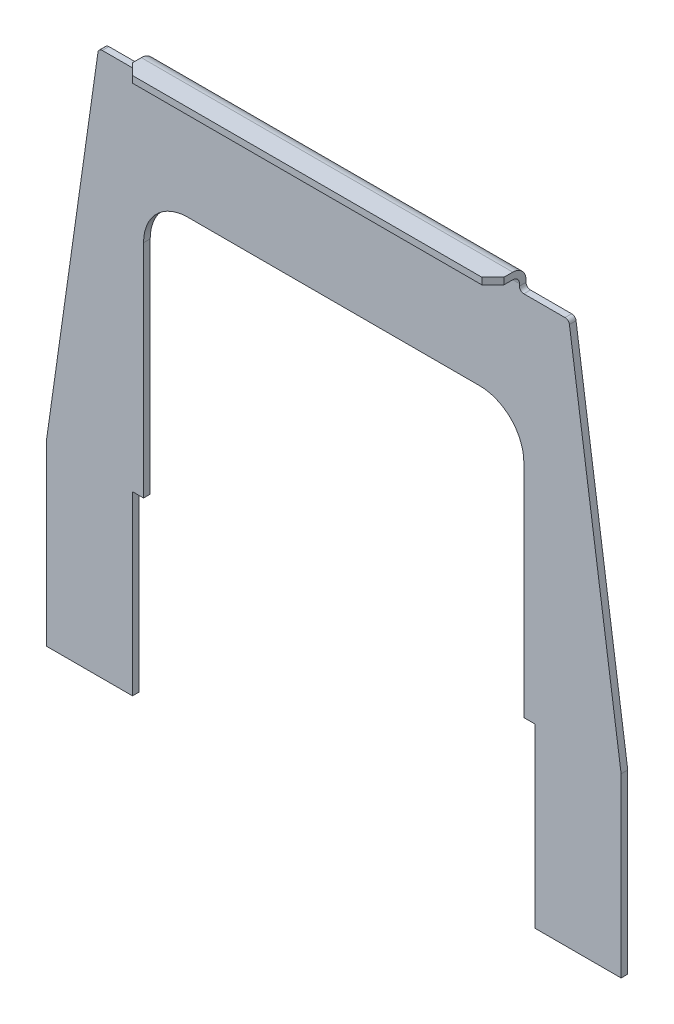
ISO-10303-21;
HEADER;
FILE_DESCRIPTION(('STEP AP214'),'2;1');
FILE_NAME('part.step','',(''),(''),'','','');
FILE_SCHEMA(('AUTOMOTIVE_DESIGN { 1 0 10303 214 1 1 1 1 }'));
ENDSEC;
DATA;
#1=APPLICATION_CONTEXT('core data for automotive mechanical design processes');
#2=APPLICATION_PROTOCOL_DEFINITION('international standard','automotive_design',2000,#1);
#3=PRODUCT_CONTEXT('',#1,'mechanical');
#4=PRODUCT('Part','Part','',(#3));
#5=PRODUCT_RELATED_PRODUCT_CATEGORY('part','',(#4));
#6=PRODUCT_DEFINITION_FORMATION('','',#4);
#7=PRODUCT_DEFINITION_CONTEXT('part definition',#1,'design');
#8=PRODUCT_DEFINITION('design','',#6,#7);
#9=PRODUCT_DEFINITION_SHAPE('','',#8);
#10=(LENGTH_UNIT() NAMED_UNIT(*) SI_UNIT(.MILLI.,.METRE.));
#11=(NAMED_UNIT(*) PLANE_ANGLE_UNIT() SI_UNIT($,.RADIAN.));
#12=(NAMED_UNIT(*) SI_UNIT($,.STERADIAN.) SOLID_ANGLE_UNIT());
#13=UNCERTAINTY_MEASURE_WITH_UNIT(LENGTH_MEASURE(1.E-05),#10,'distance_accuracy_value','');
#14=(GEOMETRIC_REPRESENTATION_CONTEXT(3) GLOBAL_UNCERTAINTY_ASSIGNED_CONTEXT((#13)) GLOBAL_UNIT_ASSIGNED_CONTEXT((#10,
#11,#12)) REPRESENTATION_CONTEXT('',''));
#15=CARTESIAN_POINT('',(0.,0.,0.));
#16=DIRECTION('',(0.,0.,1.));
#17=DIRECTION('',(1.,0.,0.));
#18=AXIS2_PLACEMENT_3D('',#15,#16,#17);
#19=CARTESIAN_POINT('',(130.,252.,7.10707993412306));
#20=DIRECTION('',(0.,-1.,0.));
#21=DIRECTION('',(0.,0.,-1.));
#22=AXIS2_PLACEMENT_3D('',#19,#20,#21);
#23=PLANE('',#22);
#24=DIRECTION('',(1.,0.,0.));
#25=VECTOR('',#24,1.);
#26=CARTESIAN_POINT('',(130.,252.,6.00000000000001));
#27=LINE('',#26,#25);
#28=CARTESIAN_POINT('',(45.9999999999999,252.,6.00000000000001));
#29=VERTEX_POINT('',#28);
#30=CARTESIAN_POINT('',(214.,252.,6.00000000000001));
#31=VERTEX_POINT('',#30);
#32=EDGE_CURVE('E299',#29,#31,#27,.T.);
#33=ORIENTED_EDGE('',*,*,#32,.T.);
#34=DIRECTION('',(0.,0.,-1.));
#35=VECTOR('',#34,1.);
#36=CARTESIAN_POINT('',(214.,252.,6.00000000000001));
#37=LINE('',#36,#35);
#38=CARTESIAN_POINT('',(214.,252.,10.));
#39=VERTEX_POINT('',#38);
#40=EDGE_CURVE('E212',#39,#31,#37,.T.);
#41=ORIENTED_EDGE('',*,*,#40,.F.);
#42=DIRECTION('',(0.707106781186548,0.,-0.707106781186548));
#43=VECTOR('',#42,1.);
#44=CARTESIAN_POINT('',(211.5,252.,12.5));
#45=LINE('',#44,#43);
#46=CARTESIAN_POINT('',(209.,252.,15.));
#47=VERTEX_POINT('',#46);
#48=EDGE_CURVE('E353',#47,#39,#45,.T.);
#49=ORIENTED_EDGE('',*,*,#48,.F.);
#50=DIRECTION('',(1.,0.,0.));
#51=VECTOR('',#50,1.);
#52=CARTESIAN_POINT('',(214.,252.,15.));
#53=LINE('',#52,#51);
#54=CARTESIAN_POINT('',(50.9999999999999,252.,15.));
#55=VERTEX_POINT('',#54);
#56=EDGE_CURVE('E382',#55,#47,#53,.T.);
#57=ORIENTED_EDGE('',*,*,#56,.F.);
#58=DIRECTION('',(0.707106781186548,0.,0.707106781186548));
#59=VECTOR('',#58,1.);
#60=CARTESIAN_POINT('',(48.4999999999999,252.,12.5));
#61=LINE('',#60,#59);
#62=CARTESIAN_POINT('',(45.9999999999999,252.,10.));
#63=VERTEX_POINT('',#62);
#64=EDGE_CURVE('E370',#63,#55,#61,.T.);
#65=ORIENTED_EDGE('',*,*,#64,.F.);
#66=DIRECTION('',(0.,0.,1.));
#67=VECTOR('',#66,1.);
#68=CARTESIAN_POINT('',(45.9999999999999,252.,6.00000000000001));
#69=LINE('',#68,#67);
#70=EDGE_CURVE('E342',#29,#63,#69,.T.);
#71=ORIENTED_EDGE('',*,*,#70,.F.);
#72=EDGE_LOOP('',(#33,#41,#49,#57,#65,#71));
#73=FACE_BOUND('',#72,.T.);
#74=ADVANCED_FACE('F17',(#73),#23,.T.);
#75=CARTESIAN_POINT('',(214.,252.,15.));
#76=DIRECTION('',(0.,0.,1.));
#77=DIRECTION('',(0.,-1.,0.));
#78=AXIS2_PLACEMENT_3D('',#75,#76,#77);
#79=PLANE('',#78);
#80=DIRECTION('',(0.,1.,0.));
#81=VECTOR('',#80,1.);
#82=CARTESIAN_POINT('',(50.9999999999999,252.,15.));
#83=LINE('',#82,#81);
#84=CARTESIAN_POINT('',(50.9999999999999,255.,15.));
#85=VERTEX_POINT('',#84);
#86=EDGE_CURVE('E367',#55,#85,#83,.T.);
#87=ORIENTED_EDGE('',*,*,#86,.F.);
#88=ORIENTED_EDGE('',*,*,#56,.T.);
#89=DIRECTION('',(0.,1.,0.));
#90=VECTOR('',#89,1.);
#91=CARTESIAN_POINT('',(209.,252.,15.));
#92=LINE('',#91,#90);
#93=CARTESIAN_POINT('',(209.,255.,15.));
#94=VERTEX_POINT('',#93);
#95=EDGE_CURVE('E369',#94,#47,#92,.F.);
#96=ORIENTED_EDGE('',*,*,#95,.F.);
#97=DIRECTION('',(1.,0.,0.));
#98=VECTOR('',#97,1.);
#99=CARTESIAN_POINT('',(130.,255.,15.));
#100=LINE('',#99,#98);
#101=EDGE_CURVE('E298',#94,#85,#100,.F.);
#102=ORIENTED_EDGE('',*,*,#101,.T.);
#103=EDGE_LOOP('',(#87,#88,#96,#102));
#104=FACE_BOUND('',#103,.T.);
#105=ADVANCED_FACE('F850',(#104),#79,.T.);
#106=CARTESIAN_POINT('',(48.4999999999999,252.,12.5));
#107=DIRECTION('',(-0.707106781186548,0.,0.707106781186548));
#108=DIRECTION('',(0.707106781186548,0.,0.707106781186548));
#109=AXIS2_PLACEMENT_3D('',#106,#107,#108);
#110=PLANE('',#109);
#111=ORIENTED_EDGE('',*,*,#64,.T.);
#112=ORIENTED_EDGE('',*,*,#86,.T.);
#113=DIRECTION('',(-0.707106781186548,0.,-0.707106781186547));
#114=VECTOR('',#113,1.);
#115=CARTESIAN_POINT('',(50.9999999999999,255.,15.));
#116=LINE('',#115,#114);
#117=CARTESIAN_POINT('',(45.9999999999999,255.,10.));
#118=VERTEX_POINT('',#117);
#119=EDGE_CURVE('E285',#85,#118,#116,.T.);
#120=ORIENTED_EDGE('',*,*,#119,.T.);
#121=DIRECTION('',(0.,1.,0.));
#122=VECTOR('',#121,1.);
#123=CARTESIAN_POINT('',(45.9999999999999,252.,10.));
#124=LINE('',#123,#122);
#125=EDGE_CURVE('E345',#63,#118,#124,.T.);
#126=ORIENTED_EDGE('',*,*,#125,.F.);
#127=EDGE_LOOP('',(#111,#112,#120,#126));
#128=FACE_BOUND('',#127,.T.);
#129=ADVANCED_FACE('F840',(#128),#110,.T.);
#130=CARTESIAN_POINT('',(211.5,252.,12.5));
#131=DIRECTION('',(0.707106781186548,0.,0.707106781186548));
#132=DIRECTION('',(0.707106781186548,0.,-0.707106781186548));
#133=AXIS2_PLACEMENT_3D('',#130,#131,#132);
#134=PLANE('',#133);
#135=ORIENTED_EDGE('',*,*,#48,.T.);
#136=DIRECTION('',(0.,1.,0.));
#137=VECTOR('',#136,1.);
#138=CARTESIAN_POINT('',(214.,252.,10.));
#139=LINE('',#138,#137);
#140=CARTESIAN_POINT('',(214.,255.,10.));
#141=VERTEX_POINT('',#140);
#142=EDGE_CURVE('E349',#141,#39,#139,.F.);
#143=ORIENTED_EDGE('',*,*,#142,.F.);
#144=DIRECTION('',(-0.707106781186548,0.,0.707106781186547));
#145=VECTOR('',#144,1.);
#146=CARTESIAN_POINT('',(214.,255.,10.));
#147=LINE('',#146,#145);
#148=EDGE_CURVE('E224',#141,#94,#147,.T.);
#149=ORIENTED_EDGE('',*,*,#148,.T.);
#150=ORIENTED_EDGE('',*,*,#95,.T.);
#151=EDGE_LOOP('',(#135,#143,#149,#150));
#152=FACE_BOUND('',#151,.T.);
#153=ADVANCED_FACE('F831',(#152),#134,.T.);
#154=CARTESIAN_POINT('',(130.,249.,6.));
#155=DIRECTION('',(1.,0.,0.));
#156=DIRECTION('',(0.,0.,-1.));
#157=AXIS2_PLACEMENT_3D('',#154,#155,#156);
#158=CYLINDRICAL_SURFACE('',#157,3.);
#159=CARTESIAN_POINT('',(45.9999999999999,249.,6.));
#160=DIRECTION('',(1.,0.,0.));
#161=DIRECTION('',(0.,0.,-1.));
#162=AXIS2_PLACEMENT_3D('',#159,#160,#161);
#163=CIRCLE('',#162,3.);
#164=CARTESIAN_POINT('',(45.9999999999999,249.,3.));
#165=VERTEX_POINT('',#164);
#166=EDGE_CURVE('E223',#165,#29,#163,.T.);
#167=ORIENTED_EDGE('',*,*,#166,.F.);
#168=DIRECTION('',(1.,0.,0.));
#169=VECTOR('',#168,1.);
#170=CARTESIAN_POINT('',(130.,249.,3.));
#171=LINE('',#170,#169);
#172=CARTESIAN_POINT('',(214.,249.,3.));
#173=VERTEX_POINT('',#172);
#174=EDGE_CURVE('E226',#173,#165,#171,.F.);
#175=ORIENTED_EDGE('',*,*,#174,.F.);
#176=CARTESIAN_POINT('',(214.,249.,6.));
#177=DIRECTION('',(1.,0.,0.));
#178=DIRECTION('',(0.,0.,-1.));
#179=AXIS2_PLACEMENT_3D('',#176,#177,#178);
#180=CIRCLE('',#179,3.);
#181=EDGE_CURVE('E20',#31,#173,#180,.F.);
#182=ORIENTED_EDGE('',*,*,#181,.F.);
#183=ORIENTED_EDGE('',*,*,#32,.F.);
#184=EDGE_LOOP('',(#167,#175,#182,#183));
#185=FACE_BOUND('',#184,.T.);
#186=ADVANCED_FACE('F227',(#185),#158,.F.);
#187=CARTESIAN_POINT('',(130.,255.,7.10707993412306));
#188=DIRECTION('',(0.,-1.,0.));
#189=DIRECTION('',(0.,0.,-1.));
#190=AXIS2_PLACEMENT_3D('',#187,#188,#189);
#191=PLANE('',#190);
#192=DIRECTION('',(0.,0.,-1.));
#193=VECTOR('',#192,1.);
#194=CARTESIAN_POINT('',(214.,255.,7.10707993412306));
#195=LINE('',#194,#193);
#196=CARTESIAN_POINT('',(214.,255.,6.00000000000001));
#197=VERTEX_POINT('',#196);
#198=EDGE_CURVE('E284',#197,#141,#195,.F.);
#199=ORIENTED_EDGE('',*,*,#198,.F.);
#200=DIRECTION('',(1.,0.,0.));
#201=VECTOR('',#200,1.);
#202=CARTESIAN_POINT('',(130.,255.,6.00000000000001));
#203=LINE('',#202,#201);
#204=CARTESIAN_POINT('',(45.9999999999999,255.,6.00000000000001));
#205=VERTEX_POINT('',#204);
#206=EDGE_CURVE('E278',#205,#197,#203,.T.);
#207=ORIENTED_EDGE('',*,*,#206,.F.);
#208=DIRECTION('',(0.,0.,-1.));
#209=VECTOR('',#208,1.);
#210=CARTESIAN_POINT('',(45.9999999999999,255.,7.10707993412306));
#211=LINE('',#210,#209);
#212=EDGE_CURVE('E282',#118,#205,#211,.T.);
#213=ORIENTED_EDGE('',*,*,#212,.F.);
#214=ORIENTED_EDGE('',*,*,#119,.F.);
#215=ORIENTED_EDGE('',*,*,#101,.F.);
#216=ORIENTED_EDGE('',*,*,#148,.F.);
#217=EDGE_LOOP('',(#199,#207,#213,#214,#215,#216));
#218=FACE_BOUND('',#217,.T.);
#219=ADVANCED_FACE('F813',(#218),#191,.F.);
#220=CARTESIAN_POINT('',(214.,252.,6.00000000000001));
#221=DIRECTION('',(1.,0.,0.));
#222=DIRECTION('',(0.,0.,-1.));
#223=AXIS2_PLACEMENT_3D('',#220,#221,#222);
#224=PLANE('',#223);
#225=ORIENTED_EDGE('',*,*,#181,.T.);
#226=DIRECTION('',(0.,1.,0.));
#227=VECTOR('',#226,1.);
#228=CARTESIAN_POINT('',(214.,127.5,3.));
#229=LINE('',#228,#227);
#230=CARTESIAN_POINT('',(214.,248.,3.));
#231=VERTEX_POINT('',#230);
#232=EDGE_CURVE('E220',#231,#173,#229,.T.);
#233=ORIENTED_EDGE('',*,*,#232,.F.);
#234=DIRECTION('',(0.,0.,-1.));
#235=VECTOR('',#234,1.);
#236=CARTESIAN_POINT('',(214.,248.,3.));
#237=LINE('',#236,#235);
#238=CARTESIAN_POINT('',(214.,248.,0.));
#239=VERTEX_POINT('',#238);
#240=EDGE_CURVE('E450',#231,#239,#237,.T.);
#241=ORIENTED_EDGE('',*,*,#240,.T.);
#242=DIRECTION('',(0.,1.,0.));
#243=VECTOR('',#242,1.);
#244=CARTESIAN_POINT('',(214.,246.,0.));
#245=LINE('',#244,#243);
#246=CARTESIAN_POINT('',(214.,249.,0.));
#247=VERTEX_POINT('',#246);
#248=EDGE_CURVE('E296',#247,#239,#245,.F.);
#249=ORIENTED_EDGE('',*,*,#248,.F.);
#250=CARTESIAN_POINT('',(214.,249.,6.));
#251=DIRECTION('',(1.,0.,0.));
#252=DIRECTION('',(0.,0.,-1.));
#253=AXIS2_PLACEMENT_3D('',#250,#251,#252);
#254=CIRCLE('',#253,6.);
#255=EDGE_CURVE('E281',#197,#247,#254,.F.);
#256=ORIENTED_EDGE('',*,*,#255,.F.);
#257=ORIENTED_EDGE('',*,*,#198,.T.);
#258=ORIENTED_EDGE('',*,*,#142,.T.);
#259=ORIENTED_EDGE('',*,*,#40,.T.);
#260=EDGE_LOOP('',(#225,#233,#241,#249,#256,#257,#258,#259));
#261=FACE_BOUND('',#260,.T.);
#262=ADVANCED_FACE('F217',(#261),#224,.T.);
#263=CARTESIAN_POINT('',(45.9999999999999,255.,3.));
#264=DIRECTION('',(1.,0.,0.));
#265=DIRECTION('',(0.,1.,0.));
#266=AXIS2_PLACEMENT_3D('',#263,#264,#265);
#267=PLANE('',#266);
#268=DIRECTION('',(0.,1.,0.));
#269=VECTOR('',#268,1.);
#270=CARTESIAN_POINT('',(45.9999999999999,127.5,3.));
#271=LINE('',#270,#269);
#272=CARTESIAN_POINT('',(45.9999999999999,248.,3.));
#273=VERTEX_POINT('',#272);
#274=EDGE_CURVE('E231',#165,#273,#271,.F.);
#275=ORIENTED_EDGE('',*,*,#274,.F.);
#276=ORIENTED_EDGE('',*,*,#166,.T.);
#277=ORIENTED_EDGE('',*,*,#70,.T.);
#278=ORIENTED_EDGE('',*,*,#125,.T.);
#279=ORIENTED_EDGE('',*,*,#212,.T.);
#280=CARTESIAN_POINT('',(45.9999999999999,249.,6.));
#281=DIRECTION('',(1.,0.,0.));
#282=DIRECTION('',(0.,0.,-1.));
#283=AXIS2_PLACEMENT_3D('',#280,#281,#282);
#284=CIRCLE('',#283,6.);
#285=CARTESIAN_POINT('',(45.9999999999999,249.,0.));
#286=VERTEX_POINT('',#285);
#287=EDGE_CURVE('E418',#286,#205,#284,.T.);
#288=ORIENTED_EDGE('',*,*,#287,.F.);
#289=DIRECTION('',(0.,1.,0.));
#290=VECTOR('',#289,1.);
#291=CARTESIAN_POINT('',(45.9999999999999,255.,0.));
#292=LINE('',#291,#290);
#293=CARTESIAN_POINT('',(45.9999999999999,248.,0.));
#294=VERTEX_POINT('',#293);
#295=EDGE_CURVE('E237',#294,#286,#292,.T.);
#296=ORIENTED_EDGE('',*,*,#295,.F.);
#297=DIRECTION('',(0.,0.,-1.));
#298=VECTOR('',#297,1.);
#299=CARTESIAN_POINT('',(45.9999999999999,248.,3.));
#300=LINE('',#299,#298);
#301=EDGE_CURVE('E417',#294,#273,#300,.F.);
#302=ORIENTED_EDGE('',*,*,#301,.T.);
#303=EDGE_LOOP('',(#275,#276,#277,#278,#279,#288,#296,#302));
#304=FACE_BOUND('',#303,.T.);
#305=ADVANCED_FACE('F431',(#304),#267,.F.);
#306=CARTESIAN_POINT('',(130.,127.5,3.));
#307=DIRECTION('',(0.,0.,1.));
#308=DIRECTION('',(1.,0.,0.));
#309=AXIS2_PLACEMENT_3D('',#306,#307,#308);
#310=PLANE('',#309);
#311=DIRECTION('',(0.,-1.,0.));
#312=VECTOR('',#311,1.);
#313=CARTESIAN_POINT('',(0.,0.,3.));
#314=LINE('',#313,#312);
#315=CARTESIAN_POINT('',(0.,0.,3.));
#316=VERTEX_POINT('',#315);
#317=CARTESIAN_POINT('',(0.,80.,3.));
#318=VERTEX_POINT('',#317);
#319=EDGE_CURVE('E262',#316,#318,#314,.F.);
#320=ORIENTED_EDGE('',*,*,#319,.F.);
#321=DIRECTION('',(1.,0.,0.));
#322=VECTOR('',#321,1.);
#323=CARTESIAN_POINT('',(260.,0.,3.));
#324=LINE('',#323,#322);
#325=CARTESIAN_POINT('',(38.9999999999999,0.,3.));
#326=VERTEX_POINT('',#325);
#327=EDGE_CURVE('E265',#326,#316,#324,.F.);
#328=ORIENTED_EDGE('',*,*,#327,.F.);
#329=DIRECTION('',(0.,1.,0.));
#330=VECTOR('',#329,1.);
#331=CARTESIAN_POINT('',(38.9999999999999,0.,3.));
#332=LINE('',#331,#330);
#333=CARTESIAN_POINT('',(38.9999999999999,80.,3.));
#334=VERTEX_POINT('',#333);
#335=EDGE_CURVE('E250',#326,#334,#332,.T.);
#336=ORIENTED_EDGE('',*,*,#335,.T.);
#337=DIRECTION('',(1.,0.,0.));
#338=VECTOR('',#337,1.);
#339=CARTESIAN_POINT('',(38.9999999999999,80.,3.));
#340=LINE('',#339,#338);
#341=CARTESIAN_POINT('',(43.9999999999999,80.,3.));
#342=VERTEX_POINT('',#341);
#343=EDGE_CURVE('E244',#334,#342,#340,.T.);
#344=ORIENTED_EDGE('',*,*,#343,.T.);
#345=DIRECTION('',(0.,1.,0.));
#346=VECTOR('',#345,1.);
#347=CARTESIAN_POINT('',(43.9999999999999,0.,3.));
#348=LINE('',#347,#346);
#349=CARTESIAN_POINT('',(43.9999999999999,180.,3.));
#350=VERTEX_POINT('',#349);
#351=EDGE_CURVE('E247',#342,#350,#348,.T.);
#352=ORIENTED_EDGE('',*,*,#351,.T.);
#353=CARTESIAN_POINT('',(63.9999999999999,180.,3.));
#354=DIRECTION('',(0.,0.,-1.));
#355=DIRECTION('',(-1.,0.,0.));
#356=AXIS2_PLACEMENT_3D('',#353,#354,#355);
#357=CIRCLE('',#356,20.);
#358=CARTESIAN_POINT('',(63.9999999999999,200.,3.));
#359=VERTEX_POINT('',#358);
#360=EDGE_CURVE('E428',#350,#359,#357,.T.);
#361=ORIENTED_EDGE('',*,*,#360,.T.);
#362=DIRECTION('',(-1.,0.,0.));
#363=VECTOR('',#362,1.);
#364=CARTESIAN_POINT('',(43.9999999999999,200.,3.));
#365=LINE('',#364,#363);
#366=CARTESIAN_POINT('',(196.,200.,3.));
#367=VERTEX_POINT('',#366);
#368=EDGE_CURVE('E333',#359,#367,#365,.F.);
#369=ORIENTED_EDGE('',*,*,#368,.T.);
#370=CARTESIAN_POINT('',(196.,180.,3.));
#371=DIRECTION('',(0.,0.,-1.));
#372=DIRECTION('',(-1.,0.,0.));
#373=AXIS2_PLACEMENT_3D('',#370,#371,#372);
#374=CIRCLE('',#373,20.);
#375=CARTESIAN_POINT('',(216.,180.,3.));
#376=VERTEX_POINT('',#375);
#377=EDGE_CURVE('E426',#367,#376,#374,.T.);
#378=ORIENTED_EDGE('',*,*,#377,.T.);
#379=DIRECTION('',(0.,1.,0.));
#380=VECTOR('',#379,1.);
#381=CARTESIAN_POINT('',(216.,200.,3.));
#382=LINE('',#381,#380);
#383=CARTESIAN_POINT('',(216.,80.,3.));
#384=VERTEX_POINT('',#383);
#385=EDGE_CURVE('E328',#376,#384,#382,.F.);
#386=ORIENTED_EDGE('',*,*,#385,.T.);
#387=DIRECTION('',(1.,0.,0.));
#388=VECTOR('',#387,1.);
#389=CARTESIAN_POINT('',(216.,80.,3.));
#390=LINE('',#389,#388);
#391=CARTESIAN_POINT('',(221.,80.,3.));
#392=VERTEX_POINT('',#391);
#393=EDGE_CURVE('E323',#384,#392,#390,.T.);
#394=ORIENTED_EDGE('',*,*,#393,.T.);
#395=DIRECTION('',(0.,1.,0.));
#396=VECTOR('',#395,1.);
#397=CARTESIAN_POINT('',(221.,80.,3.));
#398=LINE('',#397,#396);
#399=CARTESIAN_POINT('',(221.,0.,3.));
#400=VERTEX_POINT('',#399);
#401=EDGE_CURVE('E318',#392,#400,#398,.F.);
#402=ORIENTED_EDGE('',*,*,#401,.T.);
#403=DIRECTION('',(1.,0.,0.));
#404=VECTOR('',#403,1.);
#405=CARTESIAN_POINT('',(260.,0.,3.));
#406=LINE('',#405,#404);
#407=CARTESIAN_POINT('',(260.,0.,3.));
#408=VERTEX_POINT('',#407);
#409=EDGE_CURVE('E310',#408,#400,#406,.F.);
#410=ORIENTED_EDGE('',*,*,#409,.F.);
#411=DIRECTION('',(0.,1.,0.));
#412=VECTOR('',#411,1.);
#413=CARTESIAN_POINT('',(260.,255.,3.));
#414=LINE('',#413,#412);
#415=CARTESIAN_POINT('',(260.,80.,3.));
#416=VERTEX_POINT('',#415);
#417=EDGE_CURVE('E307',#416,#408,#414,.F.);
#418=ORIENTED_EDGE('',*,*,#417,.F.);
#419=DIRECTION('',(0.140901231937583,-0.990023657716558,0.));
#420=VECTOR('',#419,1.);
#421=CARTESIAN_POINT('',(236.374701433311,246.,3.));
#422=LINE('',#421,#420);
#423=CARTESIAN_POINT('',(236.619237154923,244.281802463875,3.));
#424=VERTEX_POINT('',#423);
#425=EDGE_CURVE('E300',#416,#424,#422,.F.);
#426=ORIENTED_EDGE('',*,*,#425,.T.);
#427=CARTESIAN_POINT('',(234.63918983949,244.,3.));
#428=DIRECTION('',(0.,0.,-1.));
#429=DIRECTION('',(-1.,0.,0.));
#430=AXIS2_PLACEMENT_3D('',#427,#428,#429);
#431=CIRCLE('',#430,2.);
#432=CARTESIAN_POINT('',(234.63918983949,246.,3.));
#433=VERTEX_POINT('',#432);
#434=EDGE_CURVE('E303',#433,#424,#431,.T.);
#435=ORIENTED_EDGE('',*,*,#434,.F.);
#436=DIRECTION('',(1.,0.,0.));
#437=VECTOR('',#436,1.);
#438=CARTESIAN_POINT('',(260.,246.,3.));
#439=LINE('',#438,#437);
#440=CARTESIAN_POINT('',(216.,246.,3.));
#441=VERTEX_POINT('',#440);
#442=EDGE_CURVE('E292',#433,#441,#439,.F.);
#443=ORIENTED_EDGE('',*,*,#442,.T.);
#444=CARTESIAN_POINT('',(216.,248.,3.));
#445=DIRECTION('',(0.,0.,-1.));
#446=DIRECTION('',(-1.,0.,0.));
#447=AXIS2_PLACEMENT_3D('',#444,#445,#446);
#448=CIRCLE('',#447,2.);
#449=EDGE_CURVE('E236',#441,#231,#448,.T.);
#450=ORIENTED_EDGE('',*,*,#449,.T.);
#451=ORIENTED_EDGE('',*,*,#232,.T.);
#452=ORIENTED_EDGE('',*,*,#174,.T.);
#453=ORIENTED_EDGE('',*,*,#274,.T.);
#454=CARTESIAN_POINT('',(43.9999999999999,248.,3.));
#455=DIRECTION('',(0.,0.,-1.));
#456=DIRECTION('',(-1.,0.,0.));
#457=AXIS2_PLACEMENT_3D('',#454,#455,#456);
#458=CIRCLE('',#457,2.);
#459=CARTESIAN_POINT('',(43.9999999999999,246.,3.));
#460=VERTEX_POINT('',#459);
#461=EDGE_CURVE('E415',#273,#460,#458,.T.);
#462=ORIENTED_EDGE('',*,*,#461,.T.);
#463=DIRECTION('',(1.,0.,0.));
#464=VECTOR('',#463,1.);
#465=CARTESIAN_POINT('',(45.9999999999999,246.,3.));
#466=LINE('',#465,#464);
#467=CARTESIAN_POINT('',(25.3608101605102,246.,3.));
#468=VERTEX_POINT('',#467);
#469=EDGE_CURVE('E269',#460,#468,#466,.F.);
#470=ORIENTED_EDGE('',*,*,#469,.T.);
#471=CARTESIAN_POINT('',(25.3608101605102,244.,3.));
#472=DIRECTION('',(0.,0.,1.));
#473=DIRECTION('',(1.,0.,0.));
#474=AXIS2_PLACEMENT_3D('',#471,#472,#473);
#475=CIRCLE('',#474,2.);
#476=CARTESIAN_POINT('',(23.3807628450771,244.281802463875,3.));
#477=VERTEX_POINT('',#476);
#478=EDGE_CURVE('E271',#477,#468,#475,.F.);
#479=ORIENTED_EDGE('',*,*,#478,.F.);
#480=DIRECTION('',(0.140901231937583,0.990023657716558,0.));
#481=VECTOR('',#480,1.);
#482=CARTESIAN_POINT('',(0.,80.,3.));
#483=LINE('',#482,#481);
#484=EDGE_CURVE('E256',#477,#318,#483,.F.);
#485=ORIENTED_EDGE('',*,*,#484,.T.);
#486=EDGE_LOOP('',(#320,#328,#336,#344,#352,#361,#369,#378,#386,#394,#402,#410,#418,#426,#435,
#443,#450,#451,#452,#453,#462,#470,#479,#485));
#487=FACE_BOUND('',#486,.T.);
#488=ADVANCED_FACE('F234',(#487),#310,.T.);
#489=CARTESIAN_POINT('',(38.9999999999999,80.,3.));
#490=DIRECTION('',(0.,1.,0.));
#491=DIRECTION('',(0.,0.,1.));
#492=AXIS2_PLACEMENT_3D('',#489,#490,#491);
#493=PLANE('',#492);
#494=DIRECTION('',(0.,0.,1.));
#495=VECTOR('',#494,1.);
#496=CARTESIAN_POINT('',(38.9999999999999,80.,3.));
#497=LINE('',#496,#495);
#498=CARTESIAN_POINT('',(38.9999999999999,80.,0.));
#499=VERTEX_POINT('',#498);
#500=EDGE_CURVE('E511',#334,#499,#497,.F.);
#501=ORIENTED_EDGE('',*,*,#500,.T.);
#502=DIRECTION('',(1.,0.,0.));
#503=VECTOR('',#502,1.);
#504=CARTESIAN_POINT('',(130.,80.,0.));
#505=LINE('',#504,#503);
#506=CARTESIAN_POINT('',(43.9999999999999,80.,0.));
#507=VERTEX_POINT('',#506);
#508=EDGE_CURVE('E253',#499,#507,#505,.T.);
#509=ORIENTED_EDGE('',*,*,#508,.T.);
#510=DIRECTION('',(0.,0.,1.));
#511=VECTOR('',#510,1.);
#512=CARTESIAN_POINT('',(43.9999999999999,80.,3.));
#513=LINE('',#512,#511);
#514=EDGE_CURVE('E338',#507,#342,#513,.T.);
#515=ORIENTED_EDGE('',*,*,#514,.T.);
#516=ORIENTED_EDGE('',*,*,#343,.F.);
#517=EDGE_LOOP('',(#501,#509,#515,#516));
#518=FACE_BOUND('',#517,.T.);
#519=ADVANCED_FACE('F572',(#518),#493,.F.);
#520=CARTESIAN_POINT('',(43.9999999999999,0.,3.));
#521=DIRECTION('',(-1.,0.,0.));
#522=DIRECTION('',(0.,0.,1.));
#523=AXIS2_PLACEMENT_3D('',#520,#521,#522);
#524=PLANE('',#523);
#525=DIRECTION('',(0.,1.,0.));
#526=VECTOR('',#525,1.);
#527=CARTESIAN_POINT('',(43.9999999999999,127.5,0.));
#528=LINE('',#527,#526);
#529=CARTESIAN_POINT('',(43.9999999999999,180.,0.));
#530=VERTEX_POINT('',#529);
#531=EDGE_CURVE('E413',#507,#530,#528,.T.);
#532=ORIENTED_EDGE('',*,*,#531,.T.);
#533=DIRECTION('',(0.,0.,-1.));
#534=VECTOR('',#533,1.);
#535=CARTESIAN_POINT('',(43.9999999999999,180.,3.));
#536=LINE('',#535,#534);
#537=EDGE_CURVE('E429',#530,#350,#536,.F.);
#538=ORIENTED_EDGE('',*,*,#537,.T.);
#539=ORIENTED_EDGE('',*,*,#351,.F.);
#540=ORIENTED_EDGE('',*,*,#514,.F.);
#541=EDGE_LOOP('',(#532,#538,#539,#540));
#542=FACE_BOUND('',#541,.T.);
#543=ADVANCED_FACE('F569',(#542),#524,.F.);
#544=CARTESIAN_POINT('',(63.9999999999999,180.,3.));
#545=DIRECTION('',(0.,0.,-1.));
#546=DIRECTION('',(-1.,0.,0.));
#547=AXIS2_PLACEMENT_3D('',#544,#545,#546);
#548=CYLINDRICAL_SURFACE('',#547,20.);
#549=ORIENTED_EDGE('',*,*,#537,.F.);
#550=CARTESIAN_POINT('',(63.9999999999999,180.,0.));
#551=DIRECTION('',(0.,0.,-1.));
#552=DIRECTION('',(-1.,0.,0.));
#553=AXIS2_PLACEMENT_3D('',#550,#551,#552);
#554=CIRCLE('',#553,20.);
#555=CARTESIAN_POINT('',(63.9999999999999,200.,0.));
#556=VERTEX_POINT('',#555);
#557=EDGE_CURVE('E410',#530,#556,#554,.T.);
#558=ORIENTED_EDGE('',*,*,#557,.T.);
#559=DIRECTION('',(0.,0.,1.));
#560=VECTOR('',#559,1.);
#561=CARTESIAN_POINT('',(63.9999999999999,200.,3.));
#562=LINE('',#561,#560);
#563=EDGE_CURVE('E336',#556,#359,#562,.T.);
#564=ORIENTED_EDGE('',*,*,#563,.T.);
#565=ORIENTED_EDGE('',*,*,#360,.F.);
#566=EDGE_LOOP('',(#549,#558,#564,#565));
#567=FACE_BOUND('',#566,.T.);
#568=ADVANCED_FACE('F762',(#567),#548,.F.);
#569=CARTESIAN_POINT('',(43.9999999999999,200.,3.));
#570=DIRECTION('',(0.,1.,0.));
#571=DIRECTION('',(-1.,0.,0.));
#572=AXIS2_PLACEMENT_3D('',#569,#570,#571);
#573=PLANE('',#572);
#574=ORIENTED_EDGE('',*,*,#368,.F.);
#575=ORIENTED_EDGE('',*,*,#563,.F.);
#576=DIRECTION('',(1.,0.,0.));
#577=VECTOR('',#576,1.);
#578=CARTESIAN_POINT('',(130.,200.,0.));
#579=LINE('',#578,#577);
#580=CARTESIAN_POINT('',(196.,200.,0.));
#581=VERTEX_POINT('',#580);
#582=EDGE_CURVE('E409',#556,#581,#579,.T.);
#583=ORIENTED_EDGE('',*,*,#582,.T.);
#584=DIRECTION('',(0.,0.,-1.));
#585=VECTOR('',#584,1.);
#586=CARTESIAN_POINT('',(196.,200.,3.));
#587=LINE('',#586,#585);
#588=EDGE_CURVE('E335',#581,#367,#587,.F.);
#589=ORIENTED_EDGE('',*,*,#588,.T.);
#590=EDGE_LOOP('',(#574,#575,#583,#589));
#591=FACE_BOUND('',#590,.T.);
#592=ADVANCED_FACE('F752',(#591),#573,.F.);
#593=CARTESIAN_POINT('',(196.,180.,3.));
#594=DIRECTION('',(0.,0.,-1.));
#595=DIRECTION('',(-1.,0.,0.));
#596=AXIS2_PLACEMENT_3D('',#593,#594,#595);
#597=CYLINDRICAL_SURFACE('',#596,20.);
#598=ORIENTED_EDGE('',*,*,#588,.F.);
#599=CARTESIAN_POINT('',(196.,180.,0.));
#600=DIRECTION('',(0.,0.,-1.));
#601=DIRECTION('',(-1.,0.,0.));
#602=AXIS2_PLACEMENT_3D('',#599,#600,#601);
#603=CIRCLE('',#602,20.);
#604=CARTESIAN_POINT('',(216.,180.,0.));
#605=VERTEX_POINT('',#604);
#606=EDGE_CURVE('E405',#581,#605,#603,.T.);
#607=ORIENTED_EDGE('',*,*,#606,.T.);
#608=DIRECTION('',(0.,0.,-1.));
#609=VECTOR('',#608,1.);
#610=CARTESIAN_POINT('',(216.,180.,3.));
#611=LINE('',#610,#609);
#612=EDGE_CURVE('E330',#605,#376,#611,.F.);
#613=ORIENTED_EDGE('',*,*,#612,.T.);
#614=ORIENTED_EDGE('',*,*,#377,.F.);
#615=EDGE_LOOP('',(#598,#607,#613,#614));
#616=FACE_BOUND('',#615,.T.);
#617=ADVANCED_FACE('F742',(#616),#597,.F.);
#618=CARTESIAN_POINT('',(216.,200.,3.));
#619=DIRECTION('',(1.,0.,0.));
#620=DIRECTION('',(0.,0.,-1.));
#621=AXIS2_PLACEMENT_3D('',#618,#619,#620);
#622=PLANE('',#621);
#623=ORIENTED_EDGE('',*,*,#385,.F.);
#624=ORIENTED_EDGE('',*,*,#612,.F.);
#625=DIRECTION('',(0.,1.,0.));
#626=VECTOR('',#625,1.);
#627=CARTESIAN_POINT('',(216.,127.5,0.));
#628=LINE('',#627,#626);
#629=CARTESIAN_POINT('',(216.,80.,0.));
#630=VERTEX_POINT('',#629);
#631=EDGE_CURVE('E408',#605,#630,#628,.F.);
#632=ORIENTED_EDGE('',*,*,#631,.T.);
#633=DIRECTION('',(0.,0.,1.));
#634=VECTOR('',#633,1.);
#635=CARTESIAN_POINT('',(216.,80.,3.));
#636=LINE('',#635,#634);
#637=EDGE_CURVE('E325',#630,#384,#636,.T.);
#638=ORIENTED_EDGE('',*,*,#637,.T.);
#639=EDGE_LOOP('',(#623,#624,#632,#638));
#640=FACE_BOUND('',#639,.T.);
#641=ADVANCED_FACE('F732',(#640),#622,.F.);
#642=CARTESIAN_POINT('',(216.,80.,3.));
#643=DIRECTION('',(0.,1.,0.));
#644=DIRECTION('',(0.,0.,1.));
#645=AXIS2_PLACEMENT_3D('',#642,#643,#644);
#646=PLANE('',#645);
#647=ORIENTED_EDGE('',*,*,#637,.F.);
#648=DIRECTION('',(1.,0.,0.));
#649=VECTOR('',#648,1.);
#650=CARTESIAN_POINT('',(130.,80.,0.));
#651=LINE('',#650,#649);
#652=CARTESIAN_POINT('',(221.,80.,0.));
#653=VERTEX_POINT('',#652);
#654=EDGE_CURVE('E480',#630,#653,#651,.T.);
#655=ORIENTED_EDGE('',*,*,#654,.T.);
#656=DIRECTION('',(0.,0.,-1.));
#657=VECTOR('',#656,1.);
#658=CARTESIAN_POINT('',(221.,80.,3.));
#659=LINE('',#658,#657);
#660=EDGE_CURVE('E320',#653,#392,#659,.F.);
#661=ORIENTED_EDGE('',*,*,#660,.T.);
#662=ORIENTED_EDGE('',*,*,#393,.F.);
#663=EDGE_LOOP('',(#647,#655,#661,#662));
#664=FACE_BOUND('',#663,.T.);
#665=ADVANCED_FACE('F722',(#664),#646,.F.);
#666=CARTESIAN_POINT('',(221.,80.,3.));
#667=DIRECTION('',(1.,0.,0.));
#668=DIRECTION('',(0.,0.,-1.));
#669=AXIS2_PLACEMENT_3D('',#666,#667,#668);
#670=PLANE('',#669);
#671=ORIENTED_EDGE('',*,*,#660,.F.);
#672=DIRECTION('',(0.,1.,0.));
#673=VECTOR('',#672,1.);
#674=CARTESIAN_POINT('',(221.,127.5,0.));
#675=LINE('',#674,#673);
#676=CARTESIAN_POINT('',(221.,0.,0.));
#677=VERTEX_POINT('',#676);
#678=EDGE_CURVE('E472',#653,#677,#675,.F.);
#679=ORIENTED_EDGE('',*,*,#678,.T.);
#680=DIRECTION('',(0.,0.,-1.));
#681=VECTOR('',#680,1.);
#682=CARTESIAN_POINT('',(221.,0.,0.));
#683=LINE('',#682,#681);
#684=EDGE_CURVE('E315',#400,#677,#683,.T.);
#685=ORIENTED_EDGE('',*,*,#684,.F.);
#686=ORIENTED_EDGE('',*,*,#401,.F.);
#687=EDGE_LOOP('',(#671,#679,#685,#686));
#688=FACE_BOUND('',#687,.T.);
#689=ADVANCED_FACE('F712',(#688),#670,.F.);
#690=CARTESIAN_POINT('',(260.,0.,0.));
#691=DIRECTION('',(0.,-1.,0.));
#692=DIRECTION('',(0.,0.,-1.));
#693=AXIS2_PLACEMENT_3D('',#690,#691,#692);
#694=PLANE('',#693);
#695=DIRECTION('',(0.,0.,-1.));
#696=VECTOR('',#695,1.);
#697=CARTESIAN_POINT('',(260.,0.,0.));
#698=LINE('',#697,#696);
#699=CARTESIAN_POINT('',(260.,0.,0.));
#700=VERTEX_POINT('',#699);
#701=EDGE_CURVE('E309',#408,#700,#698,.T.);
#702=ORIENTED_EDGE('',*,*,#701,.F.);
#703=ORIENTED_EDGE('',*,*,#409,.T.);
#704=ORIENTED_EDGE('',*,*,#684,.T.);
#705=DIRECTION('',(1.,0.,0.));
#706=VECTOR('',#705,1.);
#707=CARTESIAN_POINT('',(130.,0.,0.));
#708=LINE('',#707,#706);
#709=EDGE_CURVE('E464',#677,#700,#708,.T.);
#710=ORIENTED_EDGE('',*,*,#709,.T.);
#711=EDGE_LOOP('',(#702,#703,#704,#710));
#712=FACE_BOUND('',#711,.T.);
#713=ADVANCED_FACE('F702',(#712),#694,.T.);
#714=CARTESIAN_POINT('',(260.,255.,0.));
#715=DIRECTION('',(1.,0.,0.));
#716=DIRECTION('',(0.,0.,-1.));
#717=AXIS2_PLACEMENT_3D('',#714,#715,#716);
#718=PLANE('',#717);
#719=ORIENTED_EDGE('',*,*,#701,.T.);
#720=DIRECTION('',(0.,1.,0.));
#721=VECTOR('',#720,1.);
#722=CARTESIAN_POINT('',(260.,127.5,0.));
#723=LINE('',#722,#721);
#724=CARTESIAN_POINT('',(260.,80.,0.));
#725=VERTEX_POINT('',#724);
#726=EDGE_CURVE('E461',#700,#725,#723,.T.);
#727=ORIENTED_EDGE('',*,*,#726,.T.);
#728=DIRECTION('',(0.,0.,1.));
#729=VECTOR('',#728,1.);
#730=CARTESIAN_POINT('',(260.,80.,0.));
#731=LINE('',#730,#729);
#732=EDGE_CURVE('E304',#725,#416,#731,.T.);
#733=ORIENTED_EDGE('',*,*,#732,.T.);
#734=ORIENTED_EDGE('',*,*,#417,.T.);
#735=EDGE_LOOP('',(#719,#727,#733,#734));
#736=FACE_BOUND('',#735,.T.);
#737=ADVANCED_FACE('F692',(#736),#718,.T.);
#738=CARTESIAN_POINT('',(236.374701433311,246.,0.));
#739=DIRECTION('',(-0.990023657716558,-0.140901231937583,0.));
#740=DIRECTION('',(0.140901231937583,-0.990023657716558,0.));
#741=AXIS2_PLACEMENT_3D('',#738,#739,#740);
#742=PLANE('',#741);
#743=ORIENTED_EDGE('',*,*,#425,.F.);
#744=ORIENTED_EDGE('',*,*,#732,.F.);
#745=DIRECTION('',(-0.140901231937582,0.990023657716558,0.));
#746=VECTOR('',#745,1.);
#747=CARTESIAN_POINT('',(260.,80.,0.));
#748=LINE('',#747,#746);
#749=CARTESIAN_POINT('',(236.619237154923,244.281802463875,0.));
#750=VERTEX_POINT('',#749);
#751=EDGE_CURVE('E404',#725,#750,#748,.T.);
#752=ORIENTED_EDGE('',*,*,#751,.T.);
#753=DIRECTION('',(0.,0.,-1.));
#754=VECTOR('',#753,1.);
#755=CARTESIAN_POINT('',(236.619237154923,244.281802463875,1.5));
#756=LINE('',#755,#754);
#757=EDGE_CURVE('E295',#424,#750,#756,.T.);
#758=ORIENTED_EDGE('',*,*,#757,.F.);
#759=EDGE_LOOP('',(#743,#744,#752,#758));
#760=FACE_BOUND('',#759,.T.);
#761=ADVANCED_FACE('F682',(#760),#742,.F.);
#762=CARTESIAN_POINT('',(234.63918983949,244.,1.5));
#763=DIRECTION('',(0.,0.,-1.));
#764=DIRECTION('',(-1.,0.,0.));
#765=AXIS2_PLACEMENT_3D('',#762,#763,#764);
#766=CYLINDRICAL_SURFACE('',#765,2.);
#767=ORIENTED_EDGE('',*,*,#434,.T.);
#768=ORIENTED_EDGE('',*,*,#757,.T.);
#769=CARTESIAN_POINT('',(234.63918983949,244.,0.));
#770=DIRECTION('',(0.,0.,-1.));
#771=DIRECTION('',(-1.,0.,0.));
#772=AXIS2_PLACEMENT_3D('',#769,#770,#771);
#773=CIRCLE('',#772,2.);
#774=CARTESIAN_POINT('',(234.63918983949,246.,0.));
#775=VERTEX_POINT('',#774);
#776=EDGE_CURVE('E401',#750,#775,#773,.F.);
#777=ORIENTED_EDGE('',*,*,#776,.T.);
#778=DIRECTION('',(0.,0.,-1.));
#779=VECTOR('',#778,1.);
#780=CARTESIAN_POINT('',(234.63918983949,246.,3.));
#781=LINE('',#780,#779);
#782=EDGE_CURVE('E294',#775,#433,#781,.F.);
#783=ORIENTED_EDGE('',*,*,#782,.T.);
#784=EDGE_LOOP('',(#767,#768,#777,#783));
#785=FACE_BOUND('',#784,.T.);
#786=ADVANCED_FACE('F672',(#785),#766,.T.);
#787=CARTESIAN_POINT('',(260.,246.,3.));
#788=DIRECTION('',(0.,-1.,0.));
#789=DIRECTION('',(0.,0.,-1.));
#790=AXIS2_PLACEMENT_3D('',#787,#788,#789);
#791=PLANE('',#790);
#792=DIRECTION('',(1.,0.,0.));
#793=VECTOR('',#792,1.);
#794=CARTESIAN_POINT('',(130.,246.,0.));
#795=LINE('',#794,#793);
#796=CARTESIAN_POINT('',(216.,246.,0.));
#797=VERTEX_POINT('',#796);
#798=EDGE_CURVE('E400',#775,#797,#795,.F.);
#799=ORIENTED_EDGE('',*,*,#798,.T.);
#800=DIRECTION('',(0.,0.,-1.));
#801=VECTOR('',#800,1.);
#802=CARTESIAN_POINT('',(216.,246.,3.));
#803=LINE('',#802,#801);
#804=EDGE_CURVE('E424',#797,#441,#803,.F.);
#805=ORIENTED_EDGE('',*,*,#804,.T.);
#806=ORIENTED_EDGE('',*,*,#442,.F.);
#807=ORIENTED_EDGE('',*,*,#782,.F.);
#808=EDGE_LOOP('',(#799,#805,#806,#807));
#809=FACE_BOUND('',#808,.T.);
#810=ADVANCED_FACE('F662',(#809),#791,.F.);
#811=CARTESIAN_POINT('',(216.,248.,3.));
#812=DIRECTION('',(0.,0.,-1.));
#813=DIRECTION('',(-1.,0.,0.));
#814=AXIS2_PLACEMENT_3D('',#811,#812,#813);
#815=CYLINDRICAL_SURFACE('',#814,2.);
#816=ORIENTED_EDGE('',*,*,#804,.F.);
#817=CARTESIAN_POINT('',(216.,248.,0.));
#818=DIRECTION('',(0.,0.,-1.));
#819=DIRECTION('',(-1.,0.,0.));
#820=AXIS2_PLACEMENT_3D('',#817,#818,#819);
#821=CIRCLE('',#820,2.);
#822=EDGE_CURVE('E277',#797,#239,#821,.T.);
#823=ORIENTED_EDGE('',*,*,#822,.T.);
#824=ORIENTED_EDGE('',*,*,#240,.F.);
#825=ORIENTED_EDGE('',*,*,#449,.F.);
#826=EDGE_LOOP('',(#816,#823,#824,#825));
#827=FACE_BOUND('',#826,.T.);
#828=ADVANCED_FACE('F652',(#827),#815,.F.);
#829=CARTESIAN_POINT('',(130.,249.,6.));
#830=DIRECTION('',(1.,0.,0.));
#831=DIRECTION('',(0.,0.,-1.));
#832=AXIS2_PLACEMENT_3D('',#829,#830,#831);
#833=CYLINDRICAL_SURFACE('',#832,6.);
#834=DIRECTION('',(1.,0.,0.));
#835=VECTOR('',#834,1.);
#836=CARTESIAN_POINT('',(130.,249.,0.));
#837=LINE('',#836,#835);
#838=EDGE_CURVE('E274',#247,#286,#837,.F.);
#839=ORIENTED_EDGE('',*,*,#838,.T.);
#840=ORIENTED_EDGE('',*,*,#287,.T.);
#841=ORIENTED_EDGE('',*,*,#206,.T.);
#842=ORIENTED_EDGE('',*,*,#255,.T.);
#843=EDGE_LOOP('',(#839,#840,#841,#842));
#844=FACE_BOUND('',#843,.T.);
#845=ADVANCED_FACE('F643',(#844),#833,.T.);
#846=CARTESIAN_POINT('',(43.9999999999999,248.,3.));
#847=DIRECTION('',(0.,0.,-1.));
#848=DIRECTION('',(-1.,0.,0.));
#849=AXIS2_PLACEMENT_3D('',#846,#847,#848);
#850=CYLINDRICAL_SURFACE('',#849,2.);
#851=ORIENTED_EDGE('',*,*,#301,.F.);
#852=CARTESIAN_POINT('',(43.9999999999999,248.,0.));
#853=DIRECTION('',(0.,0.,-1.));
#854=DIRECTION('',(-1.,0.,0.));
#855=AXIS2_PLACEMENT_3D('',#852,#853,#854);
#856=CIRCLE('',#855,2.);
#857=CARTESIAN_POINT('',(43.9999999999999,246.,0.));
#858=VERTEX_POINT('',#857);
#859=EDGE_CURVE('E276',#294,#858,#856,.T.);
#860=ORIENTED_EDGE('',*,*,#859,.T.);
#861=DIRECTION('',(0.,0.,-1.));
#862=VECTOR('',#861,1.);
#863=CARTESIAN_POINT('',(43.9999999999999,246.,3.));
#864=LINE('',#863,#862);
#865=EDGE_CURVE('E272',#858,#460,#864,.F.);
#866=ORIENTED_EDGE('',*,*,#865,.T.);
#867=ORIENTED_EDGE('',*,*,#461,.F.);
#868=EDGE_LOOP('',(#851,#860,#866,#867));
#869=FACE_BOUND('',#868,.T.);
#870=ADVANCED_FACE('F440',(#869),#850,.F.);
#871=CARTESIAN_POINT('',(45.9999999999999,246.,3.));
#872=DIRECTION('',(0.,-1.,0.));
#873=DIRECTION('',(0.,0.,-1.));
#874=AXIS2_PLACEMENT_3D('',#871,#872,#873);
#875=PLANE('',#874);
#876=ORIENTED_EDGE('',*,*,#469,.F.);
#877=ORIENTED_EDGE('',*,*,#865,.F.);
#878=DIRECTION('',(1.,0.,0.));
#879=VECTOR('',#878,1.);
#880=CARTESIAN_POINT('',(130.,246.,0.));
#881=LINE('',#880,#879);
#882=CARTESIAN_POINT('',(25.3608101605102,246.,0.));
#883=VERTEX_POINT('',#882);
#884=EDGE_CURVE('E395',#858,#883,#881,.F.);
#885=ORIENTED_EDGE('',*,*,#884,.T.);
#886=DIRECTION('',(0.,0.,1.));
#887=VECTOR('',#886,1.);
#888=CARTESIAN_POINT('',(25.3608101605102,246.,1.5));
#889=LINE('',#888,#887);
#890=EDGE_CURVE('E259',#468,#883,#889,.F.);
#891=ORIENTED_EDGE('',*,*,#890,.F.);
#892=EDGE_LOOP('',(#876,#877,#885,#891));
#893=FACE_BOUND('',#892,.T.);
#894=ADVANCED_FACE('F625',(#893),#875,.F.);
#895=CARTESIAN_POINT('',(25.3608101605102,244.,1.5));
#896=DIRECTION('',(0.,0.,1.));
#897=DIRECTION('',(1.,0.,0.));
#898=AXIS2_PLACEMENT_3D('',#895,#896,#897);
#899=CYLINDRICAL_SURFACE('',#898,2.);
#900=CARTESIAN_POINT('',(25.3608101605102,244.,0.));
#901=DIRECTION('',(0.,0.,1.));
#902=DIRECTION('',(1.,0.,0.));
#903=AXIS2_PLACEMENT_3D('',#900,#901,#902);
#904=CIRCLE('',#903,2.);
#905=CARTESIAN_POINT('',(23.3807628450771,244.281802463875,0.));
#906=VERTEX_POINT('',#905);
#907=EDGE_CURVE('E391',#883,#906,#904,.T.);
#908=ORIENTED_EDGE('',*,*,#907,.T.);
#909=DIRECTION('',(0.,0.,1.));
#910=VECTOR('',#909,1.);
#911=CARTESIAN_POINT('',(23.3807628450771,244.281802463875,0.));
#912=LINE('',#911,#910);
#913=EDGE_CURVE('E258',#906,#477,#912,.T.);
#914=ORIENTED_EDGE('',*,*,#913,.T.);
#915=ORIENTED_EDGE('',*,*,#478,.T.);
#916=ORIENTED_EDGE('',*,*,#890,.T.);
#917=EDGE_LOOP('',(#908,#914,#915,#916));
#918=FACE_BOUND('',#917,.T.);
#919=ADVANCED_FACE('F616',(#918),#899,.T.);
#920=CARTESIAN_POINT('',(0.,80.,0.));
#921=DIRECTION('',(0.990023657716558,-0.140901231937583,0.));
#922=DIRECTION('',(0.140901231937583,0.990023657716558,0.));
#923=AXIS2_PLACEMENT_3D('',#920,#921,#922);
#924=PLANE('',#923);
#925=DIRECTION('',(-0.140901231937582,-0.990023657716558,0.));
#926=VECTOR('',#925,1.);
#927=CARTESIAN_POINT('',(23.380762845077,244.281802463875,0.));
#928=LINE('',#927,#926);
#929=CARTESIAN_POINT('',(0.,79.9999999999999,0.));
#930=VERTEX_POINT('',#929);
#931=EDGE_CURVE('E394',#906,#930,#928,.T.);
#932=ORIENTED_EDGE('',*,*,#931,.T.);
#933=DIRECTION('',(0.,0.,1.));
#934=VECTOR('',#933,1.);
#935=CARTESIAN_POINT('',(0.,80.,0.));
#936=LINE('',#935,#934);
#937=EDGE_CURVE('E266',#318,#930,#936,.F.);
#938=ORIENTED_EDGE('',*,*,#937,.F.);
#939=ORIENTED_EDGE('',*,*,#484,.F.);
#940=ORIENTED_EDGE('',*,*,#913,.F.);
#941=EDGE_LOOP('',(#932,#938,#939,#940));
#942=FACE_BOUND('',#941,.T.);
#943=ADVANCED_FACE('F546',(#942),#924,.F.);
#944=CARTESIAN_POINT('',(0.,0.,0.));
#945=DIRECTION('',(-1.,0.,0.));
#946=DIRECTION('',(0.,-1.,0.));
#947=AXIS2_PLACEMENT_3D('',#944,#945,#946);
#948=PLANE('',#947);
#949=DIRECTION('',(0.,0.,-1.));
#950=VECTOR('',#949,1.);
#951=CARTESIAN_POINT('',(0.,0.,0.));
#952=LINE('',#951,#950);
#953=CARTESIAN_POINT('',(0.,0.,0.));
#954=VERTEX_POINT('',#953);
#955=EDGE_CURVE('E514',#316,#954,#952,.T.);
#956=ORIENTED_EDGE('',*,*,#955,.F.);
#957=ORIENTED_EDGE('',*,*,#319,.T.);
#958=ORIENTED_EDGE('',*,*,#937,.T.);
#959=DIRECTION('',(0.,1.,0.));
#960=VECTOR('',#959,1.);
#961=CARTESIAN_POINT('',(0.,127.5,0.));
#962=LINE('',#961,#960);
#963=EDGE_CURVE('E530',#930,#954,#962,.F.);
#964=ORIENTED_EDGE('',*,*,#963,.T.);
#965=EDGE_LOOP('',(#956,#957,#958,#964));
#966=FACE_BOUND('',#965,.T.);
#967=ADVANCED_FACE('F539',(#966),#948,.T.);
#968=CARTESIAN_POINT('',(260.,0.,0.));
#969=DIRECTION('',(0.,-1.,0.));
#970=DIRECTION('',(0.,0.,-1.));
#971=AXIS2_PLACEMENT_3D('',#968,#969,#970);
#972=PLANE('',#971);
#973=ORIENTED_EDGE('',*,*,#955,.T.);
#974=DIRECTION('',(1.,0.,0.));
#975=VECTOR('',#974,1.);
#976=CARTESIAN_POINT('',(130.,0.,0.));
#977=LINE('',#976,#975);
#978=CARTESIAN_POINT('',(38.9999999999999,0.,0.));
#979=VERTEX_POINT('',#978);
#980=EDGE_CURVE('E26',#954,#979,#977,.T.);
#981=ORIENTED_EDGE('',*,*,#980,.T.);
#982=DIRECTION('',(0.,0.,1.));
#983=VECTOR('',#982,1.);
#984=CARTESIAN_POINT('',(38.9999999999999,0.,3.));
#985=LINE('',#984,#983);
#986=EDGE_CURVE('E34',#979,#326,#985,.T.);
#987=ORIENTED_EDGE('',*,*,#986,.T.);
#988=ORIENTED_EDGE('',*,*,#327,.T.);
#989=EDGE_LOOP('',(#973,#981,#987,#988));
#990=FACE_BOUND('',#989,.T.);
#991=ADVANCED_FACE('F574',(#990),#972,.T.);
#992=CARTESIAN_POINT('',(38.9999999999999,0.,3.));
#993=DIRECTION('',(-1.,0.,0.));
#994=DIRECTION('',(0.,0.,1.));
#995=AXIS2_PLACEMENT_3D('',#992,#993,#994);
#996=PLANE('',#995);
#997=ORIENTED_EDGE('',*,*,#986,.F.);
#998=DIRECTION('',(0.,1.,0.));
#999=VECTOR('',#998,1.);
#1000=CARTESIAN_POINT('',(38.9999999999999,127.5,0.));
#1001=LINE('',#1000,#999);
#1002=EDGE_CURVE('E11',#979,#499,#1001,.T.);
#1003=ORIENTED_EDGE('',*,*,#1002,.T.);
#1004=ORIENTED_EDGE('',*,*,#500,.F.);
#1005=ORIENTED_EDGE('',*,*,#335,.F.);
#1006=EDGE_LOOP('',(#997,#1003,#1004,#1005));
#1007=FACE_BOUND('',#1006,.T.);
#1008=ADVANCED_FACE('F573',(#1007),#996,.F.);
#1009=CARTESIAN_POINT('',(130.,127.5,0.));
#1010=DIRECTION('',(0.,0.,1.));
#1011=DIRECTION('',(1.,0.,0.));
#1012=AXIS2_PLACEMENT_3D('',#1009,#1010,#1011);
#1013=PLANE('',#1012);
#1014=ORIENTED_EDGE('',*,*,#980,.F.);
#1015=ORIENTED_EDGE('',*,*,#963,.F.);
#1016=ORIENTED_EDGE('',*,*,#931,.F.);
#1017=ORIENTED_EDGE('',*,*,#907,.F.);
#1018=ORIENTED_EDGE('',*,*,#884,.F.);
#1019=ORIENTED_EDGE('',*,*,#859,.F.);
#1020=ORIENTED_EDGE('',*,*,#295,.T.);
#1021=ORIENTED_EDGE('',*,*,#838,.F.);
#1022=ORIENTED_EDGE('',*,*,#248,.T.);
#1023=ORIENTED_EDGE('',*,*,#822,.F.);
#1024=ORIENTED_EDGE('',*,*,#798,.F.);
#1025=ORIENTED_EDGE('',*,*,#776,.F.);
#1026=ORIENTED_EDGE('',*,*,#751,.F.);
#1027=ORIENTED_EDGE('',*,*,#726,.F.);
#1028=ORIENTED_EDGE('',*,*,#709,.F.);
#1029=ORIENTED_EDGE('',*,*,#678,.F.);
#1030=ORIENTED_EDGE('',*,*,#654,.F.);
#1031=ORIENTED_EDGE('',*,*,#631,.F.);
#1032=ORIENTED_EDGE('',*,*,#606,.F.);
#1033=ORIENTED_EDGE('',*,*,#582,.F.);
#1034=ORIENTED_EDGE('',*,*,#557,.F.);
#1035=ORIENTED_EDGE('',*,*,#531,.F.);
#1036=ORIENTED_EDGE('',*,*,#508,.F.);
#1037=ORIENTED_EDGE('',*,*,#1002,.F.);
#1038=EDGE_LOOP('',(#1014,#1015,#1016,#1017,#1018,#1019,#1020,#1021,#1022,#1023,#1024,#1025,
#1026,#1027,#1028,#1029,#1030,#1031,#1032,#1033,#1034,#1035,#1036,#1037));
#1039=FACE_BOUND('',#1038,.T.);
#1040=ADVANCED_FACE('F544',(#1039),#1013,.F.);
#1041=CLOSED_SHELL('',(#74,#105,#129,#153,#186,#219,#262,#305,#488,#519,#543,#568,#592,#617,
#641,#665,#689,#713,#737,#761,#786,#810,#828,#845,#870,#894,#919,#943,#967,#991,#1008,#1040));
#1042=MANIFOLD_SOLID_BREP('B1',#1041);
#1043=ADVANCED_BREP_SHAPE_REPRESENTATION('',(#18,#1042),#14);
#1044=SHAPE_DEFINITION_REPRESENTATION(#9,#1043);
ENDSEC;
END-ISO-10303-21;
